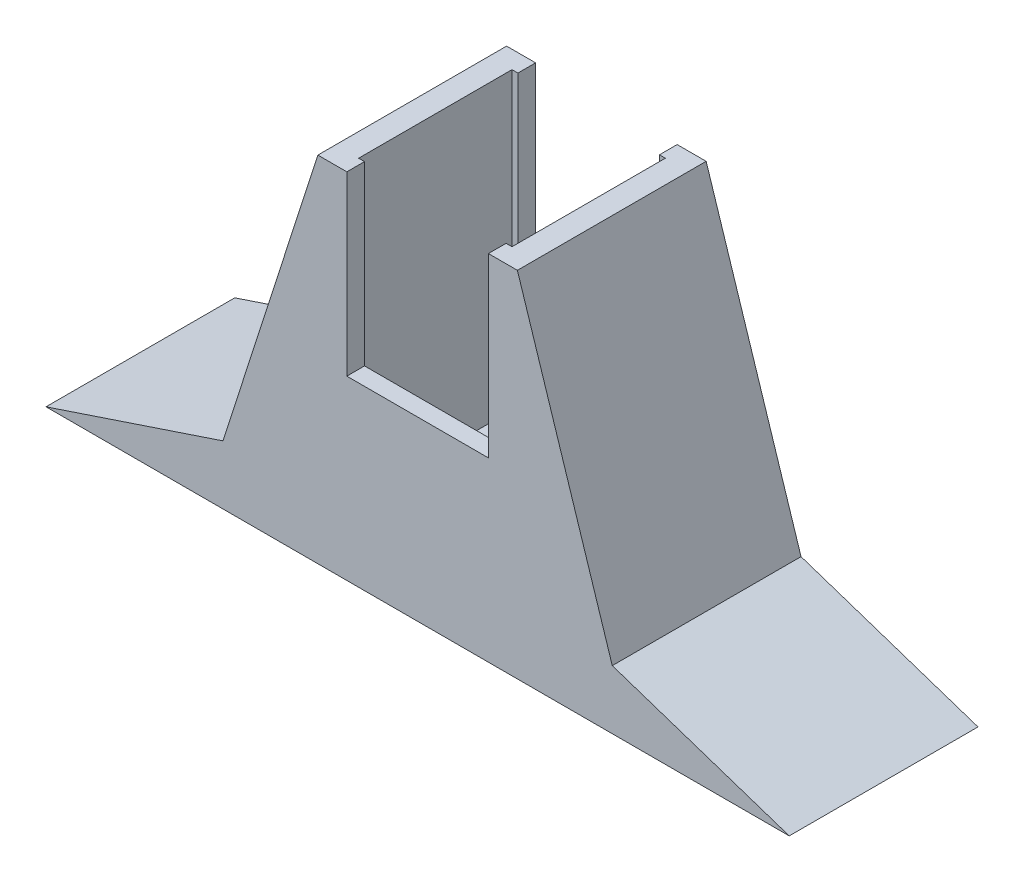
from build123d import *

# Parameters (mm, degrees)
EXTRUDE_2_DEPTH     = 16
SKETCH_3_W          = 13
SKETCH_3_H          = 13
CUT_EXTRUDE_3_DEPTH = 25
SKETCH_6_W          = 6
SKETCH_6_H          = 15
CUT_EXTRUDE_4_DEPTH = 25
EXTRUDE_3_DEPTH     = 16


with BuildPart() as part:
    # Sketch 1 → Extrude 2 (new body)
    with BuildSketch(Plane.XY):
        Polygon((31.5, 0), (-31.5, 0), (-16.5, 5), (-11.5, 10), (-8.457539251, 30), (8.457539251, 30), (11.5, 10), (16.5, 5), align=None)
    extrude(amount=EXTRUDE_2_DEPTH)

    # Sketch 3 → Cut-Extrude 3 (cut)
    with BuildSketch(Plane(origin=(0, 30, 0), x_dir=(1, 0, 0), z_dir=(0, 1, 0))):
        with Locations((0, -8)):
            Rectangle(SKETCH_3_W, SKETCH_3_H)
    extrude(amount=-CUT_EXTRUDE_3_DEPTH, mode=Mode.SUBTRACT)

    # Sketch 6 → Cut-Extrude 4 (cut)
    with BuildSketch(Plane.XY.offset(16)):
        with Locations((3, 22.5)):
            Rectangle(SKETCH_6_W, SKETCH_6_H)
        with Locations((-3, 22.5)):
            Rectangle(SKETCH_6_W, SKETCH_6_H)
    extrude(amount=-CUT_EXTRUDE_4_DEPTH, mode=Mode.SUBTRACT)

    # Sketch 7 → Extrude 3 (add)
    with BuildSketch(Plane.XY.offset(16)):
        Polygon((-16.5, 5), (-8.457539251, 30), (-11.5, 10), align=None)
        Polygon((8.457539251, 30), (11.5, 10), (16.5, 5), align=None)
    extrude(amount=-EXTRUDE_3_DEPTH)


solid = part.part
